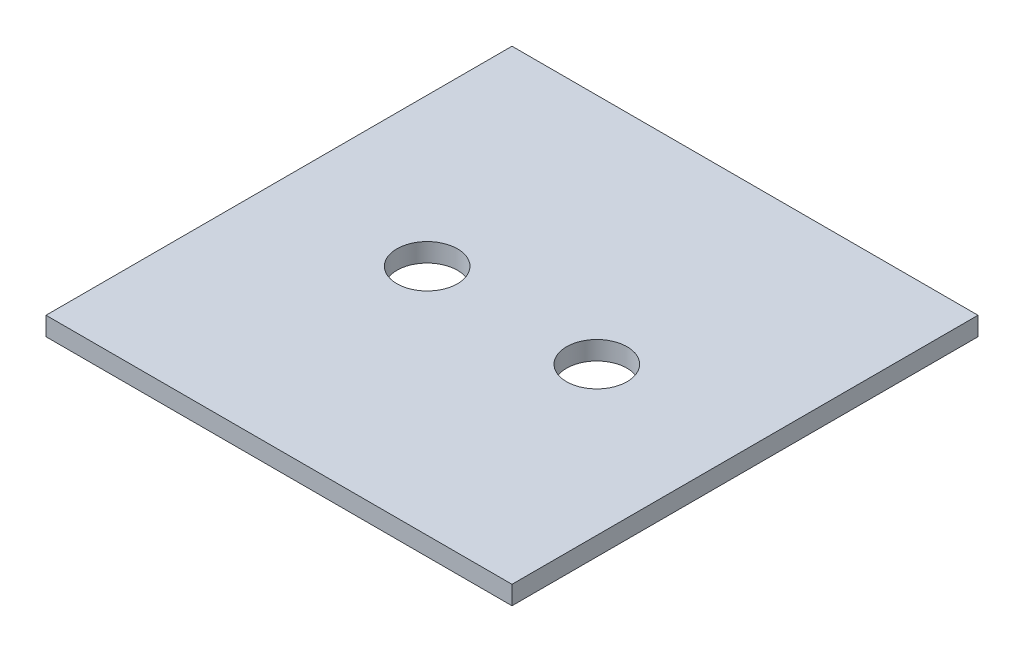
ISO-10303-21;
HEADER;
FILE_DESCRIPTION(('STEP AP214'),'2;1');
FILE_NAME('part.step','',(''),(''),'','','');
FILE_SCHEMA(('AUTOMOTIVE_DESIGN { 1 0 10303 214 1 1 1 1 }'));
ENDSEC;
DATA;
#1=APPLICATION_CONTEXT('core data for automotive mechanical design processes');
#2=APPLICATION_PROTOCOL_DEFINITION('international standard','automotive_design',2000,#1);
#3=PRODUCT_CONTEXT('',#1,'mechanical');
#4=PRODUCT('Part','Part','',(#3));
#5=PRODUCT_RELATED_PRODUCT_CATEGORY('part','',(#4));
#6=PRODUCT_DEFINITION_FORMATION('','',#4);
#7=PRODUCT_DEFINITION_CONTEXT('part definition',#1,'design');
#8=PRODUCT_DEFINITION('design','',#6,#7);
#9=PRODUCT_DEFINITION_SHAPE('','',#8);
#10=(LENGTH_UNIT() NAMED_UNIT(*) SI_UNIT(.MILLI.,.METRE.));
#11=(NAMED_UNIT(*) PLANE_ANGLE_UNIT() SI_UNIT($,.RADIAN.));
#12=(NAMED_UNIT(*) SI_UNIT($,.STERADIAN.) SOLID_ANGLE_UNIT());
#13=UNCERTAINTY_MEASURE_WITH_UNIT(LENGTH_MEASURE(1.E-05),#10,'distance_accuracy_value','');
#14=(GEOMETRIC_REPRESENTATION_CONTEXT(3) GLOBAL_UNCERTAINTY_ASSIGNED_CONTEXT((#13)) GLOBAL_UNIT_ASSIGNED_CONTEXT((#10,
#11,#12)) REPRESENTATION_CONTEXT('',''));
#15=CARTESIAN_POINT('',(0.,0.,0.));
#16=DIRECTION('',(0.,0.,1.));
#17=DIRECTION('',(1.,0.,0.));
#18=AXIS2_PLACEMENT_3D('',#15,#16,#17);
#19=CARTESIAN_POINT('',(250.,20.,250.));
#20=DIRECTION('',(-1.,0.,0.));
#21=DIRECTION('',(0.,0.,1.));
#22=AXIS2_PLACEMENT_3D('',#19,#20,#21);
#23=PLANE('',#22);
#24=DIRECTION('',(0.,0.,-1.));
#25=VECTOR('',#24,1.);
#26=CARTESIAN_POINT('',(250.,0.,250.));
#27=LINE('',#26,#25);
#28=CARTESIAN_POINT('',(250.,0.,250.));
#29=VERTEX_POINT('',#28);
#30=CARTESIAN_POINT('',(250.,0.,-250.));
#31=VERTEX_POINT('',#30);
#32=EDGE_CURVE('E100',#29,#31,#27,.T.);
#33=ORIENTED_EDGE('',*,*,#32,.T.);
#34=DIRECTION('',(0.,-1.,0.));
#35=VECTOR('',#34,1.);
#36=CARTESIAN_POINT('',(250.,20.,-250.));
#37=LINE('',#36,#35);
#38=CARTESIAN_POINT('',(250.,20.,-250.));
#39=VERTEX_POINT('',#38);
#40=EDGE_CURVE('E11',#39,#31,#37,.T.);
#41=ORIENTED_EDGE('',*,*,#40,.F.);
#42=DIRECTION('',(0.,0.,-1.));
#43=VECTOR('',#42,1.);
#44=CARTESIAN_POINT('',(250.,20.,250.));
#45=LINE('',#44,#43);
#46=CARTESIAN_POINT('',(250.,20.,250.));
#47=VERTEX_POINT('',#46);
#48=EDGE_CURVE('E88',#47,#39,#45,.T.);
#49=ORIENTED_EDGE('',*,*,#48,.F.);
#50=DIRECTION('',(0.,-1.,0.));
#51=VECTOR('',#50,1.);
#52=CARTESIAN_POINT('',(250.,20.,250.));
#53=LINE('',#52,#51);
#54=EDGE_CURVE('E96',#47,#29,#53,.T.);
#55=ORIENTED_EDGE('',*,*,#54,.T.);
#56=EDGE_LOOP('',(#33,#41,#49,#55));
#57=FACE_BOUND('',#56,.T.);
#58=ADVANCED_FACE('F37',(#57),#23,.F.);
#59=CARTESIAN_POINT('',(-250.,20.,-250.));
#60=DIRECTION('',(0.,0.,1.));
#61=DIRECTION('',(1.,0.,0.));
#62=AXIS2_PLACEMENT_3D('',#59,#60,#61);
#63=PLANE('',#62);
#64=DIRECTION('',(-1.,0.,0.));
#65=VECTOR('',#64,1.);
#66=CARTESIAN_POINT('',(-250.,0.,-250.));
#67=LINE('',#66,#65);
#68=CARTESIAN_POINT('',(-250.,0.,-250.));
#69=VERTEX_POINT('',#68);
#70=EDGE_CURVE('E92',#31,#69,#67,.T.);
#71=ORIENTED_EDGE('',*,*,#70,.T.);
#72=DIRECTION('',(0.,-1.,0.));
#73=VECTOR('',#72,1.);
#74=CARTESIAN_POINT('',(-250.,20.,-250.));
#75=LINE('',#74,#73);
#76=CARTESIAN_POINT('',(-250.,20.,-250.));
#77=VERTEX_POINT('',#76);
#78=EDGE_CURVE('E45',#77,#69,#75,.T.);
#79=ORIENTED_EDGE('',*,*,#78,.F.);
#80=DIRECTION('',(-1.,0.,0.));
#81=VECTOR('',#80,1.);
#82=CARTESIAN_POINT('',(-250.,20.,-250.));
#83=LINE('',#82,#81);
#84=EDGE_CURVE('E83',#39,#77,#83,.T.);
#85=ORIENTED_EDGE('',*,*,#84,.F.);
#86=ORIENTED_EDGE('',*,*,#40,.T.);
#87=EDGE_LOOP('',(#71,#79,#85,#86));
#88=FACE_BOUND('',#87,.T.);
#89=ADVANCED_FACE('F91',(#88),#63,.F.);
#90=CARTESIAN_POINT('',(-250.,20.,250.));
#91=DIRECTION('',(1.,0.,0.));
#92=DIRECTION('',(0.,0.,-1.));
#93=AXIS2_PLACEMENT_3D('',#90,#91,#92);
#94=PLANE('',#93);
#95=DIRECTION('',(0.,0.,1.));
#96=VECTOR('',#95,1.);
#97=CARTESIAN_POINT('',(-250.,0.,250.));
#98=LINE('',#97,#96);
#99=CARTESIAN_POINT('',(-250.,0.,250.));
#100=VERTEX_POINT('',#99);
#101=EDGE_CURVE('E70',#69,#100,#98,.T.);
#102=ORIENTED_EDGE('',*,*,#101,.T.);
#103=DIRECTION('',(0.,-1.,0.));
#104=VECTOR('',#103,1.);
#105=CARTESIAN_POINT('',(-250.,20.,250.));
#106=LINE('',#105,#104);
#107=CARTESIAN_POINT('',(-250.,20.,250.));
#108=VERTEX_POINT('',#107);
#109=EDGE_CURVE('E93',#108,#100,#106,.T.);
#110=ORIENTED_EDGE('',*,*,#109,.F.);
#111=DIRECTION('',(0.,0.,1.));
#112=VECTOR('',#111,1.);
#113=CARTESIAN_POINT('',(-250.,20.,250.));
#114=LINE('',#113,#112);
#115=EDGE_CURVE('E86',#77,#108,#114,.T.);
#116=ORIENTED_EDGE('',*,*,#115,.F.);
#117=ORIENTED_EDGE('',*,*,#78,.T.);
#118=EDGE_LOOP('',(#102,#110,#116,#117));
#119=FACE_BOUND('',#118,.T.);
#120=ADVANCED_FACE('F94',(#119),#94,.F.);
#121=CARTESIAN_POINT('',(-250.,20.,250.));
#122=DIRECTION('',(0.,0.,-1.));
#123=DIRECTION('',(-1.,0.,0.));
#124=AXIS2_PLACEMENT_3D('',#121,#122,#123);
#125=PLANE('',#124);
#126=DIRECTION('',(1.,0.,0.));
#127=VECTOR('',#126,1.);
#128=CARTESIAN_POINT('',(-250.,0.,250.));
#129=LINE('',#128,#127);
#130=EDGE_CURVE('E76',#100,#29,#129,.T.);
#131=ORIENTED_EDGE('',*,*,#130,.T.);
#132=ORIENTED_EDGE('',*,*,#54,.F.);
#133=DIRECTION('',(1.,0.,0.));
#134=VECTOR('',#133,1.);
#135=CARTESIAN_POINT('',(-250.,20.,250.));
#136=LINE('',#135,#134);
#137=EDGE_CURVE('E53',#108,#47,#136,.T.);
#138=ORIENTED_EDGE('',*,*,#137,.F.);
#139=ORIENTED_EDGE('',*,*,#109,.T.);
#140=EDGE_LOOP('',(#131,#132,#138,#139));
#141=FACE_BOUND('',#140,.T.);
#142=ADVANCED_FACE('F108',(#141),#125,.F.);
#143=CARTESIAN_POINT('',(0.,20.,0.));
#144=DIRECTION('',(0.,-1.,0.));
#145=DIRECTION('',(0.,0.,-1.));
#146=AXIS2_PLACEMENT_3D('',#143,#144,#145);
#147=PLANE('',#146);
#148=CARTESIAN_POINT('',(-91.,20.,0.));
#149=DIRECTION('',(0.,1.,0.));
#150=DIRECTION('',(0.,0.,1.));
#151=AXIS2_PLACEMENT_3D('',#148,#149,#150);
#152=CIRCLE('',#151,32.5);
#153=CARTESIAN_POINT('',(-91.,20.,32.5));
#154=VERTEX_POINT('',#153);
#155=EDGE_CURVE('E103',#154,#154,#152,.T.);
#156=ORIENTED_EDGE('',*,*,#155,.F.);
#157=EDGE_LOOP('',(#156));
#158=FACE_BOUND('',#157,.T.);
#159=CARTESIAN_POINT('',(91.,20.,0.));
#160=DIRECTION('',(0.,1.,0.));
#161=DIRECTION('',(0.,0.,1.));
#162=AXIS2_PLACEMENT_3D('',#159,#160,#161);
#163=CIRCLE('',#162,32.5);
#164=CARTESIAN_POINT('',(91.,20.,32.5));
#165=VERTEX_POINT('',#164);
#166=EDGE_CURVE('E117',#165,#165,#163,.T.);
#167=ORIENTED_EDGE('',*,*,#166,.F.);
#168=EDGE_LOOP('',(#167));
#169=FACE_BOUND('',#168,.T.);
#170=ORIENTED_EDGE('',*,*,#48,.T.);
#171=ORIENTED_EDGE('',*,*,#84,.T.);
#172=ORIENTED_EDGE('',*,*,#115,.T.);
#173=ORIENTED_EDGE('',*,*,#137,.T.);
#174=EDGE_LOOP('',(#170,#171,#172,#173));
#175=FACE_BOUND('',#174,.T.);
#176=ADVANCED_FACE('F84',(#158,#169,#175),#147,.F.);
#177=CARTESIAN_POINT('',(0.,0.,0.));
#178=DIRECTION('',(0.,-1.,0.));
#179=DIRECTION('',(0.,0.,-1.));
#180=AXIS2_PLACEMENT_3D('',#177,#178,#179);
#181=PLANE('',#180);
#182=CARTESIAN_POINT('',(-91.,0.,0.));
#183=DIRECTION('',(0.,1.,0.));
#184=DIRECTION('',(0.,0.,1.));
#185=AXIS2_PLACEMENT_3D('',#182,#183,#184);
#186=CIRCLE('',#185,32.5);
#187=CARTESIAN_POINT('',(-91.,0.,32.5));
#188=VERTEX_POINT('',#187);
#189=EDGE_CURVE('E120',#188,#188,#186,.T.);
#190=ORIENTED_EDGE('',*,*,#189,.T.);
#191=EDGE_LOOP('',(#190));
#192=FACE_BOUND('',#191,.T.);
#193=CARTESIAN_POINT('',(91.,0.,0.));
#194=DIRECTION('',(0.,1.,0.));
#195=DIRECTION('',(0.,0.,1.));
#196=AXIS2_PLACEMENT_3D('',#193,#194,#195);
#197=CIRCLE('',#196,32.5);
#198=CARTESIAN_POINT('',(91.,0.,32.5));
#199=VERTEX_POINT('',#198);
#200=EDGE_CURVE('E114',#199,#199,#197,.T.);
#201=ORIENTED_EDGE('',*,*,#200,.T.);
#202=EDGE_LOOP('',(#201));
#203=FACE_BOUND('',#202,.T.);
#204=ORIENTED_EDGE('',*,*,#32,.F.);
#205=ORIENTED_EDGE('',*,*,#130,.F.);
#206=ORIENTED_EDGE('',*,*,#101,.F.);
#207=ORIENTED_EDGE('',*,*,#70,.F.);
#208=EDGE_LOOP('',(#204,#205,#206,#207));
#209=FACE_BOUND('',#208,.T.);
#210=ADVANCED_FACE('F111',(#192,#203,#209),#181,.T.);
#211=CARTESIAN_POINT('',(91.,20.,0.));
#212=DIRECTION('',(0.,-1.,0.));
#213=DIRECTION('',(0.,0.,-1.));
#214=AXIS2_PLACEMENT_3D('',#211,#212,#213);
#215=CYLINDRICAL_SURFACE('',#214,32.5);
#216=ORIENTED_EDGE('',*,*,#166,.T.);
#217=EDGE_LOOP('',(#216));
#218=FACE_BOUND('',#217,.T.);
#219=ORIENTED_EDGE('',*,*,#200,.F.);
#220=EDGE_LOOP('',(#219));
#221=FACE_BOUND('',#220,.T.);
#222=ADVANCED_FACE('F134',(#218,#221),#215,.F.);
#223=CARTESIAN_POINT('',(-91.,20.,0.));
#224=DIRECTION('',(0.,-1.,0.));
#225=DIRECTION('',(0.,0.,-1.));
#226=AXIS2_PLACEMENT_3D('',#223,#224,#225);
#227=CYLINDRICAL_SURFACE('',#226,32.5);
#228=ORIENTED_EDGE('',*,*,#155,.T.);
#229=EDGE_LOOP('',(#228));
#230=FACE_BOUND('',#229,.T.);
#231=ORIENTED_EDGE('',*,*,#189,.F.);
#232=EDGE_LOOP('',(#231));
#233=FACE_BOUND('',#232,.T.);
#234=ADVANCED_FACE('F126',(#230,#233),#227,.F.);
#235=CLOSED_SHELL('',(#58,#89,#120,#142,#176,#210,#222,#234));
#236=MANIFOLD_SOLID_BREP('B2',#235);
#237=ADVANCED_BREP_SHAPE_REPRESENTATION('',(#18,#236),#14);
#238=SHAPE_DEFINITION_REPRESENTATION(#9,#237);
ENDSEC;
END-ISO-10303-21;
